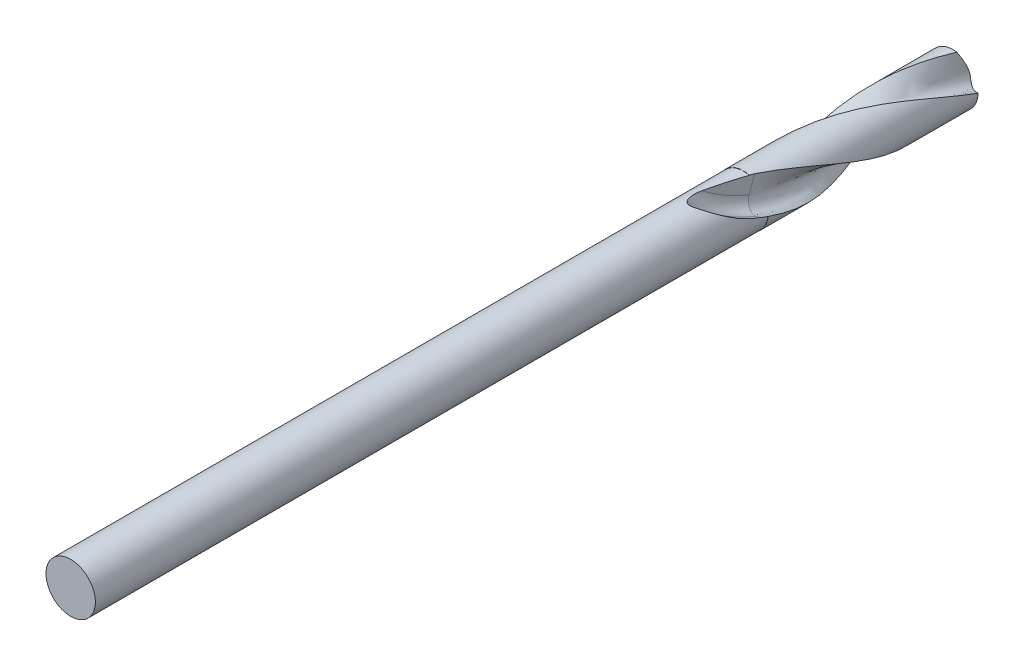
from build123d import *

# Parameters (mm, degrees)
FOPO_DENT_PITCH       = 8.63
FOPO_DENT_HEIGHT      = 5
FOPO_DENT_RADIUS      = 0.5
FOPO_DENT_START_ANGLE = 135
FOPO_DEG_ANGLE        = 90
REP_COUNT             = 2


with BuildPart() as part:
    # EsqCorps → CorpsOutil (revolve)
    with BuildSketch(Plane(origin=(0, 0, 0), x_dir=(0, 0, -1), z_dir=(1, 0, 0)), mode=Mode.PRIVATE) as corpsoutil_sk:
        Polygon((0, 0), (-18, 0), (-18, 0.496), (-4.5, 0.496), (-4.5, 0.5), (-0.288675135, 0.5), align=None)
    revolve(corpsoutil_sk.sketch.rotate(Axis((0, 0, 0.300640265), (0, 0, -1)), 180), axis=Axis((0, 0, 0.300640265), (0, 0, -1)))

    # FOPO-Dent: sweep along a helix
    with BuildLine() as fopo_dent_path:
        add(Helix(FOPO_DENT_PITCH, FOPO_DENT_HEIGHT, FOPO_DENT_RADIUS, center=(0, 0, 4.5), direction=(0, 0, -1), mode=Mode.PRIVATE).rotate(Axis((0, 0, 4.5), (0, 0, -1)), FOPO_DENT_START_ANGLE))
    # EsqDent → FOPO-Dent (sweep, cut)
    with BuildSketch(Plane(origin=(0.353553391, 0.353553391, 4.5), x_dir=(-0.9656323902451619, 0.03492966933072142, -0.25755388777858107), z_dir=(0.24188076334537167, -0.24188076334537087, -0.9396740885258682))):
        with BuildLine():
            Line((0.229053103, -0.236570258), (0.229053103, 0.618524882))
            ThreePointArc((0.229053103, 0.618524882), (-0.328822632, 0.37666394), (-0.643467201, -0.143644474))
            Line((-0.643467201, -0.143644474), (-0.05547055, -0.417831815))
            ThreePointArc((-0.05547055, -0.417831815), (0.136513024, -0.405248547), (0.229053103, -0.236570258))
        make_face()
    fopo_dent = sweep(path=fopo_dent_path.line, is_frenet=True, mode=Mode.SUBTRACT)

    # EsqDeg → FOPO-Deg (revolve, cut)
    with BuildSketch(Plane(origin=(0.353553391, 0.353553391, 4.5), x_dir=(-0.9656323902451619, 0.03492966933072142, -0.25755388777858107), z_dir=(0.24188076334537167, -0.24188076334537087, -0.9396740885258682))):
        with BuildLine():
            Line((0.229053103, -0.236570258), (0.229053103, 0.618524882))
            ThreePointArc((0.229053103, 0.618524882), (-0.328822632, 0.37666394), (-0.643467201, -0.143644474))
            Line((-0.643467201, -0.143644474), (-0.05547055, -0.417831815))
            ThreePointArc((-0.05547055, -0.417831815), (0.136513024, -0.405248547), (0.229053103, -0.236570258))
        make_face()
    fopo_deg = revolve(axis=Axis((1.696882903, 2.371413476, 4.326369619), (-0.9656323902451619, 0.03492966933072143, -0.257553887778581)), revolution_arc=FOPO_DEG_ANGLE, mode=Mode.SUBTRACT)

    # Rep: FOPO-Dent, FOPO-Deg ×2 about axis
    rep_axis = Axis((0, 0, -1.449807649), (0, 0, 1))
    add([fopo_dent.rotate(rep_axis, i * 360 / REP_COUNT) for i in range(1, REP_COUNT)], mode=Mode.SUBTRACT)
    add([fopo_deg.rotate(rep_axis, i * 360 / REP_COUNT) for i in range(1, REP_COUNT)], mode=Mode.SUBTRACT)


solid = part.part
